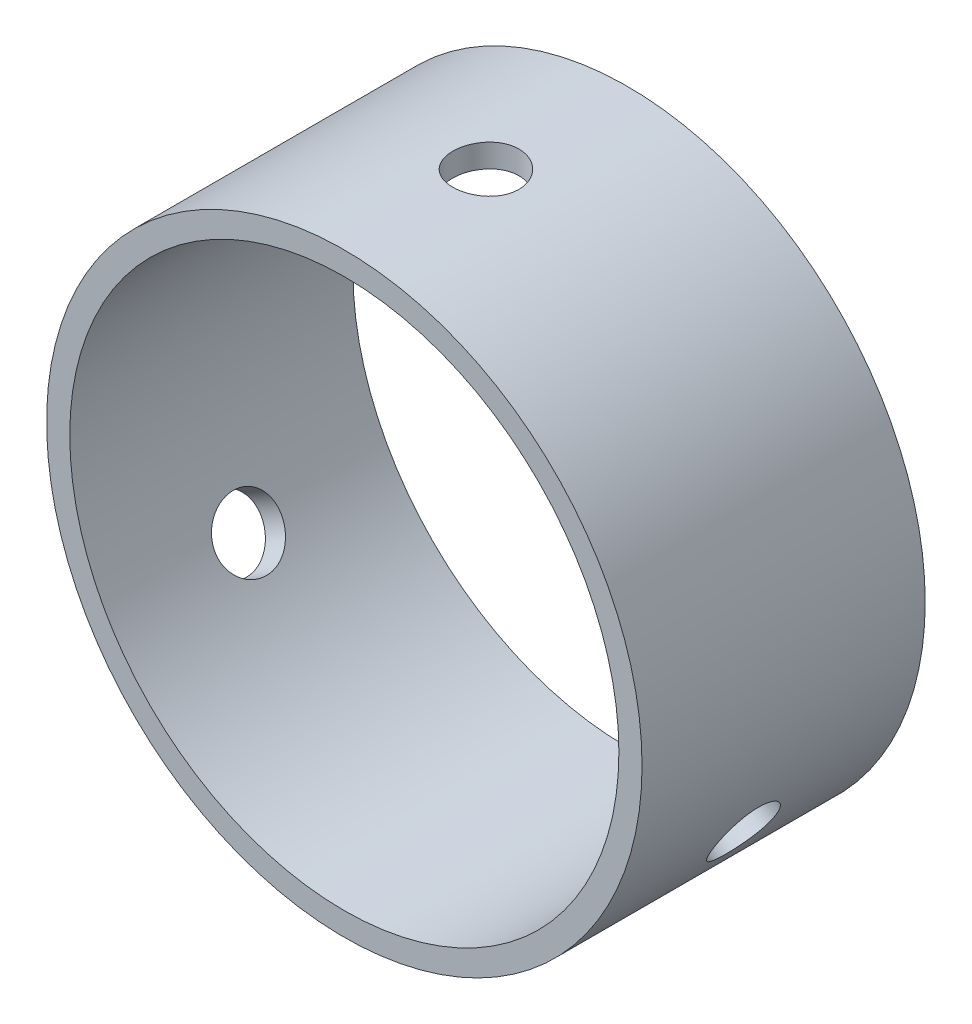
ISO-10303-21;
HEADER;
FILE_DESCRIPTION(('STEP AP214'),'2;1');
FILE_NAME('part.step','',(''),(''),'','','');
FILE_SCHEMA(('AUTOMOTIVE_DESIGN { 1 0 10303 214 1 1 1 1 }'));
ENDSEC;
DATA;
#1=APPLICATION_CONTEXT('core data for automotive mechanical design processes');
#2=APPLICATION_PROTOCOL_DEFINITION('international standard','automotive_design',2000,#1);
#3=PRODUCT_CONTEXT('',#1,'mechanical');
#4=PRODUCT('Part','Part','',(#3));
#5=PRODUCT_RELATED_PRODUCT_CATEGORY('part','',(#4));
#6=PRODUCT_DEFINITION_FORMATION('','',#4);
#7=PRODUCT_DEFINITION_CONTEXT('part definition',#1,'design');
#8=PRODUCT_DEFINITION('design','',#6,#7);
#9=PRODUCT_DEFINITION_SHAPE('','',#8);
#10=(LENGTH_UNIT() NAMED_UNIT(*) SI_UNIT(.MILLI.,.METRE.));
#11=(NAMED_UNIT(*) PLANE_ANGLE_UNIT() SI_UNIT($,.RADIAN.));
#12=(NAMED_UNIT(*) SI_UNIT($,.STERADIAN.) SOLID_ANGLE_UNIT());
#13=UNCERTAINTY_MEASURE_WITH_UNIT(LENGTH_MEASURE(1.E-05),#10,'distance_accuracy_value','');
#14=(GEOMETRIC_REPRESENTATION_CONTEXT(3) GLOBAL_UNCERTAINTY_ASSIGNED_CONTEXT((#13)) GLOBAL_UNIT_ASSIGNED_CONTEXT((#10,
#11,#12)) REPRESENTATION_CONTEXT('',''));
#15=CARTESIAN_POINT('',(0.,0.,0.));
#16=DIRECTION('',(0.,0.,1.));
#17=DIRECTION('',(1.,0.,0.));
#18=AXIS2_PLACEMENT_3D('',#15,#16,#17);
#19=CARTESIAN_POINT('',(0.,0.,27.178));
#20=DIRECTION('',(0.,0.,1.));
#21=DIRECTION('',(1.,0.,0.));
#22=AXIS2_PLACEMENT_3D('',#19,#20,#21);
#23=PLANE('',#22);
#24=CARTESIAN_POINT('',(0.,0.,27.178));
#25=DIRECTION('',(0.,0.,1.));
#26=DIRECTION('',(1.,0.,0.));
#27=AXIS2_PLACEMENT_3D('',#24,#25,#26);
#28=CIRCLE('',#27,57.15);
#29=CARTESIAN_POINT('',(57.15,0.,27.178));
#30=VERTEX_POINT('',#29);
#31=EDGE_CURVE('E10',#30,#30,#28,.T.);
#32=ORIENTED_EDGE('',*,*,#31,.T.);
#33=EDGE_LOOP('',(#32));
#34=FACE_BOUND('',#33,.T.);
#35=CARTESIAN_POINT('',(0.,0.,27.178));
#36=DIRECTION('',(0.,0.,1.));
#37=DIRECTION('',(1.,0.,0.));
#38=AXIS2_PLACEMENT_3D('',#35,#36,#37);
#39=CIRCLE('',#38,52.705);
#40=CARTESIAN_POINT('',(52.705,0.,27.178));
#41=VERTEX_POINT('',#40);
#42=EDGE_CURVE('E43',#41,#41,#39,.T.);
#43=ORIENTED_EDGE('',*,*,#42,.F.);
#44=EDGE_LOOP('',(#43));
#45=FACE_BOUND('',#44,.T.);
#46=ADVANCED_FACE('F32',(#34,#45),#23,.T.);
#47=CARTESIAN_POINT('',(0.,0.,-27.178));
#48=DIRECTION('',(0.,0.,1.));
#49=DIRECTION('',(1.,0.,0.));
#50=AXIS2_PLACEMENT_3D('',#47,#48,#49);
#51=PLANE('',#50);
#52=CARTESIAN_POINT('',(0.,0.,-27.178));
#53=DIRECTION('',(0.,0.,1.));
#54=DIRECTION('',(1.,0.,0.));
#55=AXIS2_PLACEMENT_3D('',#52,#53,#54);
#56=CIRCLE('',#55,57.15);
#57=CARTESIAN_POINT('',(57.15,0.,-27.178));
#58=VERTEX_POINT('',#57);
#59=EDGE_CURVE('E39',#58,#58,#56,.T.);
#60=ORIENTED_EDGE('',*,*,#59,.F.);
#61=EDGE_LOOP('',(#60));
#62=FACE_BOUND('',#61,.T.);
#63=CARTESIAN_POINT('',(0.,0.,-27.178));
#64=DIRECTION('',(0.,0.,1.));
#65=DIRECTION('',(1.,0.,0.));
#66=AXIS2_PLACEMENT_3D('',#63,#64,#65);
#67=CIRCLE('',#66,52.705);
#68=CARTESIAN_POINT('',(52.705,0.,-27.178));
#69=VERTEX_POINT('',#68);
#70=EDGE_CURVE('E47',#69,#69,#67,.T.);
#71=ORIENTED_EDGE('',*,*,#70,.T.);
#72=EDGE_LOOP('',(#71));
#73=FACE_BOUND('',#72,.T.);
#74=ADVANCED_FACE('F116',(#62,#73),#51,.F.);
#75=CARTESIAN_POINT('',(0.,0.,27.178));
#76=DIRECTION('',(0.,0.,-1.));
#77=DIRECTION('',(-1.,0.,0.));
#78=AXIS2_PLACEMENT_3D('',#75,#76,#77);
#79=CYLINDRICAL_SURFACE('',#78,57.15);
#80=CARTESIAN_POINT('',(-46.0118884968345,-33.8973246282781,0.));
#81=CARTESIAN_POINT('',(-46.0118870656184,-33.8973259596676,0.177812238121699));
#82=CARTESIAN_POINT('',(-46.0163488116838,-33.8912725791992,0.355596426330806));
#83=CARTESIAN_POINT('',(-46.0341459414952,-33.8670952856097,0.709952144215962));
#84=CARTESIAN_POINT('',(-46.0474834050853,-33.8489685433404,0.886523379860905));
#85=CARTESIAN_POINT('',(-46.0829049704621,-33.8007287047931,1.23726980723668));
#86=CARTESIAN_POINT('',(-46.1049958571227,-33.7706063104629,1.41144303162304));
#87=CARTESIAN_POINT('',(-46.1576955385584,-33.6985405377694,1.75608310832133));
#88=CARTESIAN_POINT('',(-46.1883074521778,-33.6565928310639,1.92654857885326));
#89=CARTESIAN_POINT('',(-46.2576849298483,-33.5611763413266,2.26232926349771));
#90=CARTESIAN_POINT('',(-46.2964422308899,-33.507719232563,2.42764950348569));
#91=CARTESIAN_POINT('',(-46.3817391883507,-33.3895504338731,2.75221864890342));
#92=CARTESIAN_POINT('',(-46.4282817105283,-33.3248345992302,2.91146529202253));
#93=CARTESIAN_POINT('',(-46.5286319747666,-33.1845797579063,3.22262180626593));
#94=CARTESIAN_POINT('',(-46.582435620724,-33.1090468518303,3.37453574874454));
#95=CARTESIAN_POINT('',(-46.6968070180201,-32.9475417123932,3.6701211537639));
#96=CARTESIAN_POINT('',(-46.757377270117,-32.8615656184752,3.81378953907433));
#97=CARTESIAN_POINT('',(-46.8848968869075,-32.6793719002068,4.09232713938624));
#98=CARTESIAN_POINT('',(-46.9518684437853,-32.5831185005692,4.22716279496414));
#99=CARTESIAN_POINT('',(-47.0913793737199,-32.381160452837,4.48657227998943));
#100=CARTESIAN_POINT('',(-47.1639207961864,-32.2754523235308,4.61114229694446));
#101=CARTESIAN_POINT('',(-47.3138346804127,-32.0552846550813,4.84905379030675));
#102=CARTESIAN_POINT('',(-47.3912055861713,-31.9408279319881,4.96239885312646));
#103=CARTESIAN_POINT('',(-47.5501084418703,-31.7037860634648,5.17714752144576));
#104=CARTESIAN_POINT('',(-47.6316419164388,-31.5811979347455,5.2785467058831));
#105=CARTESIAN_POINT('',(-47.7982888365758,-31.3284063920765,5.46884862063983));
#106=CARTESIAN_POINT('',(-47.883409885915,-31.1981865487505,5.55772287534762));
#107=CARTESIAN_POINT('',(-48.0563311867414,-30.9311630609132,5.72209622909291));
#108=CARTESIAN_POINT('',(-48.1441324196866,-30.7943569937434,5.79759035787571));
#109=CARTESIAN_POINT('',(-48.3215932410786,-30.515134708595,5.93458795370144));
#110=CARTESIAN_POINT('',(-48.4112520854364,-30.3727207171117,5.9960969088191));
#111=CARTESIAN_POINT('',(-48.5917059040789,-30.0831817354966,6.10472910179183));
#112=CARTESIAN_POINT('',(-48.6825012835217,-29.9360550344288,6.15184704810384));
#113=CARTESIAN_POINT('',(-48.9546451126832,-29.4904280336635,6.27064807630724));
#114=CARTESIAN_POINT('',(-49.1366928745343,-29.1862035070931,6.32050140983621));
#115=CARTESIAN_POINT('',(-49.4965717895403,-28.5716453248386,6.36001929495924));
#116=CARTESIAN_POINT('',(-49.6744030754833,-28.2613118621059,6.3496857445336));
#117=CARTESIAN_POINT('',(-50.0202000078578,-27.6446459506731,6.26939983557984));
#118=CARTESIAN_POINT('',(-50.1882057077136,-27.3383018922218,6.19971062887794));
#119=CARTESIAN_POINT('',(-50.5109738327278,-26.7372493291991,6.00308110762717));
#120=CARTESIAN_POINT('',(-50.6657360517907,-26.4425410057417,5.87613990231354));
#121=CARTESIAN_POINT('',(-50.9589714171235,-25.8729331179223,5.56833042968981));
#122=CARTESIAN_POINT('',(-51.0974088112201,-25.598077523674,5.38734675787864));
#123=CARTESIAN_POINT('',(-51.3550280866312,-25.0772436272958,4.97667216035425));
#124=CARTESIAN_POINT('',(-51.4742092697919,-24.8312663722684,4.74697946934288));
#125=CARTESIAN_POINT('',(-51.6920298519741,-24.3745982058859,4.2439295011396));
#126=CARTESIAN_POINT('',(-51.7905548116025,-24.1641050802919,3.97034306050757));
#127=CARTESIAN_POINT('',(-51.964926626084,-23.7868080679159,3.38806306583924));
#128=CARTESIAN_POINT('',(-52.0407734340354,-23.62000427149,3.07936943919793));
#129=CARTESIAN_POINT('',(-52.168939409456,-23.3355678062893,2.43545050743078));
#130=CARTESIAN_POINT('',(-52.2212517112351,-23.2179494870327,2.10021749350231));
#131=CARTESIAN_POINT('',(-52.3017825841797,-23.0359725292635,1.41283050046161));
#132=CARTESIAN_POINT('',(-52.3300020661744,-22.9716118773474,1.06067716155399));
#133=CARTESIAN_POINT('',(-52.3619997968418,-22.898582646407,0.35145696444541));
#134=CARTESIAN_POINT('',(-52.3659076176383,-22.889618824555,-0.00557366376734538));
#135=CARTESIAN_POINT('',(-52.3495923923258,-22.9269072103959,-0.716177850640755));
#136=CARTESIAN_POINT('',(-52.3293697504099,-22.9731584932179,-1.06975146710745));
#137=CARTESIAN_POINT('',(-52.2650644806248,-23.1190786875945,-1.76245991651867));
#138=CARTESIAN_POINT('',(-52.2210446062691,-23.2186071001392,-2.10163020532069));
#139=CARTESIAN_POINT('',(-52.1096118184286,-23.4676235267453,-2.75700925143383));
#140=CARTESIAN_POINT('',(-52.0421982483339,-23.6171129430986,-3.07321736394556));
#141=CARTESIAN_POINT('',(-51.8843730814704,-23.9618505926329,-3.67515233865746));
#142=CARTESIAN_POINT('',(-51.7938662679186,-24.1572880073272,-3.96074587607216));
#143=CARTESIAN_POINT('',(-51.5911284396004,-24.5872795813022,-4.49198913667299));
#144=CARTESIAN_POINT('',(-51.4788967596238,-24.8218349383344,-4.73763763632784));
#145=CARTESIAN_POINT('',(-51.2338277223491,-25.323815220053,-5.18313199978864));
#146=CARTESIAN_POINT('',(-51.1009004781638,-25.5913824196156,-5.38276816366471));
#147=CARTESIAN_POINT('',(-50.8171689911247,-26.1502557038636,-5.72912280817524));
#148=CARTESIAN_POINT('',(-50.6663650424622,-26.4415613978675,-5.8758421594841));
#149=CARTESIAN_POINT('',(-50.3504296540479,-27.0383150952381,-6.11185343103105));
#150=CARTESIAN_POINT('',(-50.185330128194,-27.3437309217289,-6.20126970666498));
#151=CARTESIAN_POINT('',(-49.8443969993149,-27.96037101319,-6.32051726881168));
#152=CARTESIAN_POINT('',(-49.6685637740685,-28.2715950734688,-6.35035065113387));
#153=CARTESIAN_POINT('',(-49.4011212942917,-28.7347114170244,-6.34982016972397));
#154=CARTESIAN_POINT('',(-49.3115567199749,-28.8881345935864,-6.34216191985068));
#155=CARTESIAN_POINT('',(-49.1316620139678,-29.1930386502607,-6.3119902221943));
#156=CARTESIAN_POINT('',(-49.0413321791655,-29.344520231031,-6.28948229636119));
#157=CARTESIAN_POINT('',(-48.8605568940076,-29.6445475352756,-6.22975908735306));
#158=CARTESIAN_POINT('',(-48.7701114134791,-29.7930921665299,-6.19253843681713));
#159=CARTESIAN_POINT('',(-48.5898781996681,-30.0861398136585,-6.10368229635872));
#160=CARTESIAN_POINT('',(-48.500090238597,-30.23064428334,-6.05205206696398));
#161=CARTESIAN_POINT('',(-48.3218608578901,-30.5147241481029,-5.93473684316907));
#162=CARTESIAN_POINT('',(-48.2334196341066,-30.6542988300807,-5.86904982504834));
#163=CARTESIAN_POINT('',(-48.0586720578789,-30.9275416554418,-5.72412512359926));
#164=CARTESIAN_POINT('',(-47.9723649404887,-31.0612119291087,-5.64489237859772));
#165=CARTESIAN_POINT('',(-47.8025667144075,-31.3218984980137,-5.47339322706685));
#166=CARTESIAN_POINT('',(-47.719076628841,-31.4489123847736,-5.3811221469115));
#167=CARTESIAN_POINT('',(-47.5557140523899,-31.6954005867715,-5.18425529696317));
#168=CARTESIAN_POINT('',(-47.4758402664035,-31.8148776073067,-5.07966398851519));
#169=CARTESIAN_POINT('',(-47.3199699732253,-32.0462558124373,-4.85824813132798));
#170=CARTESIAN_POINT('',(-47.2439974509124,-32.1581112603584,-4.74135889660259));
#171=CARTESIAN_POINT('',(-47.097148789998,-32.3727970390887,-4.49669768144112));
#172=CARTESIAN_POINT('',(-47.0262708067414,-32.4756306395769,-4.36892967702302));
#173=CARTESIAN_POINT('',(-46.890218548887,-32.6717639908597,-4.10328703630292));
#174=CARTESIAN_POINT('',(-46.8250477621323,-32.7650579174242,-3.96540631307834));
#175=CARTESIAN_POINT('',(-46.7011206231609,-32.9414549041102,-3.68062394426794));
#176=CARTESIAN_POINT('',(-46.6423619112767,-33.0245617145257,-3.53372564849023));
#177=CARTESIAN_POINT('',(-46.5316284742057,-33.1804042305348,-3.23136658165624));
#178=CARTESIAN_POINT('',(-46.4796779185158,-33.2531030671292,-3.07587794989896));
#179=CARTESIAN_POINT('',(-46.3833533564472,-33.3873307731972,-2.75796380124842));
#180=CARTESIAN_POINT('',(-46.3389765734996,-33.4488637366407,-2.59554085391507));
#181=CARTESIAN_POINT('',(-46.2582739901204,-33.5603832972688,-2.26498564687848));
#182=CARTESIAN_POINT('',(-46.2219417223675,-33.6103791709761,-2.0968580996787));
#183=CARTESIAN_POINT('',(-46.1576782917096,-33.6985786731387,-1.7560277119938));
#184=CARTESIAN_POINT('',(-46.1297450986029,-33.7367851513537,-1.58332598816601));
#185=CARTESIAN_POINT('',(-46.0749405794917,-33.8116132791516,-1.17808987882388));
#186=CARTESIAN_POINT('',(-46.0513314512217,-33.8437301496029,-0.944260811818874));
#187=CARTESIAN_POINT('',(-46.0198064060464,-33.8865848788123,-0.473604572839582));
#188=CARTESIAN_POINT('',(-46.0118904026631,-33.8973228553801,-0.236777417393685));
#189=CARTESIAN_POINT('',(-46.0118884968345,-33.8973246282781,0.));
#190=B_SPLINE_CURVE_WITH_KNOTS('',3,(#80,#81,#82,#83,#84,#85,#86,#87,#88,#89,#90,#91,#92,#93,
#94,#95,#96,#97,#98,#99,#100,#101,#102,#103,#104,#105,#106,#107,#108,#109,#110,#111,#112,#113,
#114,#115,#116,#117,#118,#119,#120,#121,#122,#123,#124,#125,#126,#127,#128,#129,#130,#131,#132,
#133,#134,#135,#136,#137,#138,#139,#140,#141,#142,#143,#144,#145,#146,#147,#148,#149,#150,#151,
#152,#153,#154,#155,#156,#157,#158,#159,#160,#161,#162,#163,#164,#165,#166,#167,#168,#169,#170,
#171,#172,#173,#174,#175,#176,#177,#178,#179,#180,#181,#182,#183,#184,#185,#186,#187,#188,#189),
.UNSPECIFIED.,.T.,.F.,(4,2,2,2,2,2,2,2,2,2,2,2,2,2,2,2,2,2,2,2,2,2,2,2,2,2,2,2,2,2,2,2,2,2,2,2,
2,2,2,2,2,2,2,2,2,2,2,2,2,2,2,2,2,2,4),(0.,0.533229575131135,1.06658414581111,1.60035293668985,
2.13431735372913,2.66774268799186,3.20136481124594,3.73468715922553,4.26820726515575,
4.80364915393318,5.33928900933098,5.8747571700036,6.41042288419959,6.94728744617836,
7.48435101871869,8.02120347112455,8.55825308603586,9.62673898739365,10.695191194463,
11.7589309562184,12.822687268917,13.8887316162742,14.9548146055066,16.0266563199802,
17.0985002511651,18.1706566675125,19.2427725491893,20.3091695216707,21.3755486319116,
22.4391293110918,23.5027398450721,24.5708087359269,25.6389103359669,26.7117875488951,
27.7846471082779,28.8551704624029,29.925656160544,30.458590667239,30.9913271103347,
31.5242580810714,32.0569947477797,32.5898081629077,33.1224277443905,33.6552387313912,
34.1878573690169,34.7234326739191,35.2588130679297,35.7945183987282,36.3300259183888,
36.8673858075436,37.4045482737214,37.941277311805,38.4778765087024,39.187936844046,
39.8979932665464),.UNSPECIFIED.);
#191=CARTESIAN_POINT('',(-46.0118884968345,-33.8973246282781,0.));
#192=VERTEX_POINT('',#191);
#193=EDGE_CURVE('E98',#192,#192,#190,.T.);
#194=ORIENTED_EDGE('',*,*,#193,.F.);
#195=EDGE_LOOP('',(#194));
#196=FACE_BOUND('',#195,.T.);
#197=CARTESIAN_POINT('',(52.3618884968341,-22.8988020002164,0.));
#198=CARTESIAN_POINT('',(52.3618889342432,-22.8988000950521,0.1778122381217));
#199=CARTESIAN_POINT('',(52.3588774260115,-22.9056907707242,0.355596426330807));
#200=CARTESIAN_POINT('',(52.3468378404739,-22.93319218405,0.709952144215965));
#201=CARTESIAN_POINT('',(52.3378083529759,-22.9538061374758,0.886523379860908));
#202=CARTESIAN_POINT('',(52.3137422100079,-23.0086020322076,1.23726980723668));
#203=CARTESIAN_POINT('',(52.2987008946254,-23.0427944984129,1.41144303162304));
#204=CARTESIAN_POINT('',(52.2626399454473,-23.1244666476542,1.75608310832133));
#205=CARTESIAN_POINT('',(52.2416181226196,-23.1719511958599,1.92654857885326));
#206=CARTESIAN_POINT('',(52.1936737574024,-23.2797420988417,2.26232926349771));
#207=CARTESIAN_POINT('',(52.166757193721,-23.3400354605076,2.42764950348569));
#208=CARTESIAN_POINT('',(52.1070684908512,-23.4729891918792,2.75221864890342));
#209=CARTESIAN_POINT('',(52.0742941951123,-23.5456541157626,2.91146529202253));
#210=CARTESIAN_POINT('',(52.0030050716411,-23.7026874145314,3.22262180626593));
#211=CARTESIAN_POINT('',(51.9644934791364,-23.7870491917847,3.37453574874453));
#212=CARTESIAN_POINT('',(51.8818116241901,-23.966850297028,3.67012115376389));
#213=CARTESIAN_POINT('',(51.8376392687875,-24.0622937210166,3.81378953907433));
#214=CARTESIAN_POINT('',(51.7436146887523,-24.2638258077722,4.09232713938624));
#215=CARTESIAN_POINT('',(51.6937425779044,-24.3699515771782,4.22716279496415));
#216=CARTESIAN_POINT('',(51.5885972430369,-24.5917506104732,4.48657227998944));
#217=CARTESIAN_POINT('',(51.5333220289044,-24.707427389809,4.61114229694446));
#218=CARTESIAN_POINT('',(51.4176081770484,-24.9473404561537,4.84905379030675));
#219=CARTESIAN_POINT('',(51.3571712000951,-25.0715739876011,4.96239885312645));
#220=CARTESIAN_POINT('',(51.2313383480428,-25.3277088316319,5.17714752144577));
#221=CARTESIAN_POINT('',(51.1659406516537,-25.4596129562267,5.2785467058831));
#222=CARTESIAN_POINT('',(51.0303402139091,-25.7303291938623,5.46884862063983));
#223=CARTESIAN_POINT('',(50.9601270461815,-25.8691561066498,5.55772287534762));
#224=CARTESIAN_POINT('',(50.8153385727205,-26.1524220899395,5.72209622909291));
#225=CARTESIAN_POINT('',(50.7407616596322,-26.2968632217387,5.79759035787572));
#226=CARTESIAN_POINT('',(50.5876784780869,-26.5901599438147,5.93458795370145));
#227=CARTESIAN_POINT('',(50.5091737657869,-26.7390137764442,5.99609690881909));
#228=CARTESIAN_POINT('',(50.3486525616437,-27.0400608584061,6.10472910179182));
#229=CARTESIAN_POINT('',(50.2666347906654,-27.1922553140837,6.15184704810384));
#230=CARTESIAN_POINT('',(50.0167824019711,-27.6507522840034,6.27064807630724));
#231=CARTESIAN_POINT('',(49.8443401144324,-27.9605225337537,6.32050140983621));
#232=CARTESIAN_POINT('',(49.4920565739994,-28.5794659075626,6.36001929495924));
#233=CARTESIAN_POINT('',(49.3122155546,-28.8886390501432,6.3496857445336));
#234=CARTESIAN_POINT('',(48.9510656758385,-29.4964409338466,6.26939983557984));
#235=CARTESIAN_POINT('',(48.7697667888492,-29.795110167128,6.19971062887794));
#236=CARTESIAN_POINT('',(48.4106240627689,-30.3751618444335,6.00308110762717));
#237=CARTESIAN_POINT('',(48.2327802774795,-30.6565440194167,5.87613990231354));
#238=CARTESIAN_POINT('',(47.8861030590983,-31.1952972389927,5.56833042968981));
#239=CARTESIAN_POINT('',(47.7172898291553,-31.4526153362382,5.38734675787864));
#240=CARTESIAN_POINT('',(47.3950440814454,-31.9361371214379,4.97667216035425));
#241=CARTESIAN_POINT('',(47.2416121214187,-32.1623396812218,4.74697946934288));
#242=CARTESIAN_POINT('',(46.9550361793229,-32.57931192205,4.24392950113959));
#243=CARTESIAN_POINT('',(46.8220062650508,-32.769883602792,3.97034306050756));
#244=CARTESIAN_POINT('',(46.582443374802,-33.109542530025,3.38806306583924));
#245=CARTESIAN_POINT('',(46.4759104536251,-33.2586296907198,3.07936943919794));
#246=CARTESIAN_POINT('',(46.293664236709,-33.5118429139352,2.43545050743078));
#247=CARTESIAN_POINT('',(46.2179599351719,-33.6159558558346,2.10021749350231));
#248=CARTESIAN_POINT('',(46.1006287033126,-33.7766861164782,1.4128305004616));
#249=CARTESIAN_POINT('',(46.0590004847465,-33.8333052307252,1.06067716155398));
#250=CARTESIAN_POINT('',(46.011754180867,-33.8975306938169,0.351456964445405));
#251=CARTESIAN_POINT('',(46.0059451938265,-33.9053968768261,-0.00557366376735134));
#252=CARTESIAN_POINT('',(46.0300802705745,-33.8726232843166,-0.716177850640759));
#253=CARTESIAN_POINT('',(46.0600237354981,-33.8319843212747,-1.06975146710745));
#254=CARTESIAN_POINT('',(46.1542416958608,-33.7033342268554,-1.76245991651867));
#255=CARTESIAN_POINT('',(46.218425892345,-33.6154476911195,-2.10163020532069));
#256=CARTESIAN_POINT('',(46.3783640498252,-33.3944358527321,-2.75700925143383));
#257=CARTESIAN_POINT('',(46.4741188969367,-33.2613092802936,-3.07321736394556));
#258=CARTESIAN_POINT('',(46.6937578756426,-32.9522598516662,-3.67515233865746));
#259=CARTESIAN_POINT('',(46.817758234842,-32.7761599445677,-3.96074587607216));
#260=CARTESIAN_POINT('',(47.0887729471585,-32.3855880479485,-4.49198913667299));
#261=CARTESIAN_POINT('',(47.2357880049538,-32.1711148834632,-4.73763763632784));
#262=CARTESIAN_POINT('',(47.5479811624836,-31.7078887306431,-5.18313199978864));
#263=CARTESIAN_POINT('',(47.7132375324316,-31.4589867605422,-5.38276816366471));
#264=CARTESIAN_POINT('',(48.0553702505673,-30.9338314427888,-5.72912280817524));
#265=CARTESIAN_POINT('',(48.2322464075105,-30.6575785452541,-5.87584215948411));
#266=CARTESIAN_POINT('',(48.5910825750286,-30.0855936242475,-6.11185343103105));
#267=CARTESIAN_POINT('',(48.7730306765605,-29.7899053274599,-6.20126970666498));
#268=CARTESIAN_POINT('',(49.1365900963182,-29.1863285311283,-6.32051726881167));
#269=CARTESIAN_POINT('',(49.3182014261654,-28.8784404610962,-6.35035065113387));
#270=CARTESIAN_POINT('',(49.5855507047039,-28.4152703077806,-6.34982016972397));
#271=CARTESIAN_POINT('',(49.6736367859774,-28.2609935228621,-6.34216191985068));
#272=CARTESIAN_POINT('',(49.8477440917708,-27.9527481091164,-6.3119902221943));
#273=CARTESIAN_POINT('',(49.9337660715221,-27.7987793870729,-6.28948229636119));
#274=CARTESIAN_POINT('',(50.1032096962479,-27.4922097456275,-6.22975908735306));
#275=CARTESIAN_POINT('',(50.1866303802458,-27.3396093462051,-6.19253843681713));
#276=CARTESIAN_POINT('',(50.3503004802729,-27.0369989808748,-6.10368229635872));
#277=CARTESIAN_POINT('',(50.4305510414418,-26.8869880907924,-6.05205206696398));
#278=CARTESIAN_POINT('',(50.5874567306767,-26.590596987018,-5.93473684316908));
#279=CARTESIAN_POINT('',(50.6641113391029,-26.4442172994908,-5.86904982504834));
#280=CARTESIAN_POINT('',(50.8133727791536,-26.1562600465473,-5.72412512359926));
#281=CARTESIAN_POINT('',(50.8859810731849,-26.0146807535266,-5.64489237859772));
#282=CARTESIAN_POINT('',(51.0268431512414,-25.7372878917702,-5.47339322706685));
#283=CARTESIAN_POINT('',(51.0950953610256,-25.6014764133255,-5.3811221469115));
#284=CARTESIAN_POINT('',(51.2268791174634,-25.3367561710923,-5.18425529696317));
#285=CARTESIAN_POINT('',(51.2904123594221,-25.207844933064,-5.07966398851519));
#286=CARTESIAN_POINT('',(51.4128566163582,-24.957168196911,-4.85824813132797));
#287=CARTESIAN_POINT('',(51.4717400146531,-24.835446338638,-4.74135889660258));
#288=CARTESIAN_POINT('',(51.5842390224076,-24.6009287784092,-4.49669768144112));
#289=CARTESIAN_POINT('',(51.6378565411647,-24.4881298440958,-4.36892967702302));
#290=CARTESIAN_POINT('',(51.7396868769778,-24.2722384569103,-4.10328703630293));
#291=CARTESIAN_POINT('',(51.7878963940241,-24.1691519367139,-3.96540631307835));
#292=CARTESIAN_POINT('',(51.8786970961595,-23.9736293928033,-3.68062394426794));
#293=CARTESIAN_POINT('',(51.9212903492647,-23.8811894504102,-3.53372564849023));
#294=CARTESIAN_POINT('',(52.0008872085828,-23.7073702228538,-3.23136658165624));
#295=CARTESIAN_POINT('',(52.0378709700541,-23.6260303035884,-3.07587794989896));
#296=CARTESIAN_POINT('',(52.1059532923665,-23.4754969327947,-2.75796380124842));
#297=CARTESIAN_POINT('',(52.1370540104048,-23.406299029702,-2.59554085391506));
#298=CARTESIAN_POINT('',(52.193281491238,-23.2806487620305,-2.26498564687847));
#299=CARTESIAN_POINT('',(52.2184130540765,-23.2241861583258,-2.09685809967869));
#300=CARTESIAN_POINT('',(52.2626643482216,-23.1244326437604,-1.75602771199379));
#301=CARTESIAN_POINT('',(52.2817855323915,-23.0811385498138,-1.58332598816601));
#302=CARTESIAN_POINT('',(52.3191863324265,-22.9962623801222,-1.17808987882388));
#303=CARTESIAN_POINT('',(52.3351957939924,-22.9597578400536,-0.944260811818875));
#304=CARTESIAN_POINT('',(52.3565465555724,-22.9110289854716,-0.473604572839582));
#305=CARTESIAN_POINT('',(52.3618879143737,-22.8988045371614,-0.236777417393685));
#306=CARTESIAN_POINT('',(52.3618884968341,-22.8988020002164,0.));
#307=B_SPLINE_CURVE_WITH_KNOTS('',3,(#197,#198,#199,#200,#201,#202,#203,#204,#205,#206,#207,
#208,#209,#210,#211,#212,#213,#214,#215,#216,#217,#218,#219,#220,#221,#222,#223,#224,#225,#226,
#227,#228,#229,#230,#231,#232,#233,#234,#235,#236,#237,#238,#239,#240,#241,#242,#243,#244,#245,
#246,#247,#248,#249,#250,#251,#252,#253,#254,#255,#256,#257,#258,#259,#260,#261,#262,#263,#264,
#265,#266,#267,#268,#269,#270,#271,#272,#273,#274,#275,#276,#277,#278,#279,#280,#281,#282,#283,
#284,#285,#286,#287,#288,#289,#290,#291,#292,#293,#294,#295,#296,#297,#298,#299,#300,#301,#302,
#303,#304,#305,#306),.UNSPECIFIED.,.T.,.F.,(4,2,2,2,2,2,2,2,2,2,2,2,2,2,2,2,2,2,2,2,2,2,2,2,2,2,
2,2,2,2,2,2,2,2,2,2,2,2,2,2,2,2,2,2,2,2,2,2,2,2,2,2,2,2,4),(0.,0.533229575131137,
1.06658414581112,1.60035293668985,2.13431735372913,2.66774268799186,3.20136481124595,
3.73468715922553,4.26820726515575,4.80364915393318,5.33928900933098,5.87475717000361,
6.4104228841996,6.94728744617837,7.4843510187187,8.02120347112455,8.55825308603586,
9.62673898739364,10.695191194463,11.7589309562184,12.822687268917,13.8887316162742,
14.9548146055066,16.0266563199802,17.0985002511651,18.1706566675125,19.2427725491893,
20.3091695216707,21.3755486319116,22.4391293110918,23.5027398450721,24.5708087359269,
25.6389103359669,26.7117875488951,27.7846471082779,28.8551704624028,29.925656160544,
30.458590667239,30.9913271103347,31.5242580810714,32.0569947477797,32.5898081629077,
33.1224277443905,33.6552387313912,34.1878573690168,34.7234326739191,35.2588130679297,
35.7945183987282,36.3300259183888,36.8673858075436,37.4045482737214,37.941277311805,
38.4778765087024,39.187936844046,39.8979932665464),.UNSPECIFIED.);
#308=CARTESIAN_POINT('',(52.3618884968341,-22.8988020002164,0.));
#309=VERTEX_POINT('',#308);
#310=EDGE_CURVE('E80',#309,#309,#307,.T.);
#311=ORIENTED_EDGE('',*,*,#310,.F.);
#312=EDGE_LOOP('',(#311));
#313=FACE_BOUND('',#312,.T.);
#314=CARTESIAN_POINT('',(0.,57.15,6.35));
#315=CARTESIAN_POINT('',(0.177816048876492,57.1500005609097,6.35000186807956));
#316=CARTESIAN_POINT('',(0.355604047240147,57.1491684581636,6.34252829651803));
#317=CARTESIAN_POINT('',(0.709967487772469,57.145864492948,6.31269028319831));
#318=CARTESIAN_POINT('',(0.886542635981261,57.1433922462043,6.29032235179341));
#319=CARTESIAN_POINT('',(1.23729697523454,57.13687422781,6.23083196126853));
#320=CARTESIAN_POINT('',(1.41147420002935,57.1328272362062,6.19369806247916));
#321=CARTESIAN_POINT('',(1.75612236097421,57.1232725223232,6.10493324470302));
#322=CARTESIAN_POINT('',(1.92659191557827,57.1177642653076,6.05329701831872));
#323=CARTESIAN_POINT('',(2.26238128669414,57.1054492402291,5.93596916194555));
#324=CARTESIAN_POINT('',(2.42770611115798,57.0986437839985,5.87029172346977));
#325=CARTESIAN_POINT('',(2.75228402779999,57.0839192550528,5.72529804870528));
#326=CARTESIAN_POINT('',(2.91153485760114,57.0759997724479,5.64597678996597));
#327=CARTESIAN_POINT('',(3.22269899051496,57.0592759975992,5.47432784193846));
#328=CARTESIAN_POINT('',(3.37461636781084,57.0504722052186,5.38200748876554));
#329=CARTESIAN_POINT('',(3.67020768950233,57.0322190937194,5.18494353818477));
#330=CARTESIAN_POINT('',(3.81387855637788,57.0227695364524,5.0801953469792));
#331=CARTESIAN_POINT('',(4.09241269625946,57.0034579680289,4.85864558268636));
#332=CARTESIAN_POINT('',(4.22724289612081,56.9935946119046,4.74180254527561));
#333=CARTESIAN_POINT('',(4.48664142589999,56.9737613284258,4.49714869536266));
#334=CARTESIAN_POINT('',(4.61120594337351,56.9637913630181,4.36933384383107));
#335=CARTESIAN_POINT('',(4.84910668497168,56.9440331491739,4.10371076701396));
#336=CARTESIAN_POINT('',(4.96244648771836,56.9342448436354,3.96590575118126));
#337=CARTESIAN_POINT('',(5.17718505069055,56.915119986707,3.68117684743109));
#338=CARTESIAN_POINT('',(5.27857938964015,56.9057836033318,3.53424961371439));
#339=CARTESIAN_POINT('',(5.4688758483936,56.8878111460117,3.23200533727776));
#340=CARTESIAN_POINT('',(5.55774901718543,56.8791767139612,3.0766699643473));
#341=CARTESIAN_POINT('',(5.7221200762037,56.8628759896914,2.75895795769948));
#342=CARTESIAN_POINT('',(5.79761299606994,56.8552100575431,2.59657873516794));
#343=CARTESIAN_POINT('',(5.93460809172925,56.8410739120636,2.2660325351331));
#344=CARTESIAN_POINT('',(5.99611576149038,56.8346032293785,2.09786786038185));
#345=CARTESIAN_POINT('',(6.10474532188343,56.8230369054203,1.75689037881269));
#346=CARTESIAN_POINT('',(6.15186192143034,56.8179417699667,1.58407588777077));
#347=CARTESIAN_POINT('',(6.27065904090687,56.8050000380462,1.06207377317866));
#348=CARTESIAN_POINT('',(6.320509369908,56.7994199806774,0.707578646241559));
#349=CARTESIAN_POINT('',(6.3600194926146,56.7950085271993,-0.00459375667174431));
#350=CARTESIAN_POINT('',(6.34968121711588,56.796176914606,-0.362270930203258));
#351=CARTESIAN_POINT('',(6.26938780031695,56.8050955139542,-1.06919697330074));
#352=CARTESIAN_POINT('',(6.19970056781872,56.8128161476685,-1.41847647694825));
#353=CARTESIAN_POINT('',(6.00308367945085,56.8339262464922,-2.10033818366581));
#354=CARTESIAN_POINT('',(5.87615308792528,56.8473158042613,-2.43292011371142));
#355=CARTESIAN_POINT('',(5.56836564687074,56.8782881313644,-3.07280340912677));
#356=CARTESIAN_POINT('',(5.38739092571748,56.8958800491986,-3.38004762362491));
#357=CARTESIAN_POINT('',(4.97673546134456,56.9332677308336,-3.95990361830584));
#358=CARTESIAN_POINT('',(4.74705295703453,56.9530635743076,-4.23251414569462));
#359=CARTESIAN_POINT('',(4.24401024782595,56.992760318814,-4.73692207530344));
#360=CARTESIAN_POINT('',(3.97041879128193,57.0126612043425,-4.96848891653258));
#361=CARTESIAN_POINT('',(3.38812448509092,57.0502242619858,-5.38244538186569));
#362=CARTESIAN_POINT('',(3.07942158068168,57.0678864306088,-5.5648349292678));
#363=CARTESIAN_POINT('',(2.43550006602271,57.0989898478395,-5.87525419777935));
#364=CARTESIAN_POINT('',(2.10027521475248,57.1124300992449,-6.00327107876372));
#365=CARTESIAN_POINT('',(1.41290597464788,57.1335657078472,-6.20113623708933));
#366=CARTESIAN_POINT('',(1.06076221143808,57.1412612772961,-6.27098666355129));
#367=CARTESIAN_POINT('',(0.35154657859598,57.1500130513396,-6.35024098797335));
#368=CARTESIAN_POINT('',(-0.00548934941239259,57.1511041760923,-6.3599628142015));
#369=CARTESIAN_POINT('',(-0.716105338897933,57.1466180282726,-6.31952065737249));
#370=CARTESIAN_POINT('',(-1.06968545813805,57.1410408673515,-6.26935767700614));
#371=CARTESIAN_POINT('',(-1.76242681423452,57.1238668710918,-6.11083379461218));
#372=CARTESIAN_POINT('',(-2.1016227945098,57.1122855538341,-6.00262289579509));
#373=CARTESIAN_POINT('',(-2.75705020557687,57.0844013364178,-5.73122969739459));
#374=CARTESIAN_POINT('',(-3.07328100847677,57.0680983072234,-5.56804589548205));
#375=CARTESIAN_POINT('',(-3.67523162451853,57.0325045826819,-5.19055900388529));
#376=CARTESIAN_POINT('',(-3.96082056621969,57.0132018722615,-4.97604837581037));
#377=CARTESIAN_POINT('',(-4.49205294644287,56.9738102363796,-4.502291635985));
#378=CARTESIAN_POINT('',(-4.73769514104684,56.9537212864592,-4.24304413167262));
#379=CARTESIAN_POINT('',(-5.18317562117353,56.9149149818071,-3.68578465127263));
#380=CARTESIAN_POINT('',(-5.38280436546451,56.8962041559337,-3.38760466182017));
#381=CARTESIAN_POINT('',(-5.72914599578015,56.8623760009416,-2.7617497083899));
#382=CARTESIAN_POINT('',(-5.87585974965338,56.847258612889,-2.43407522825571));
#383=CARTESIAN_POINT('',(-6.11186737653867,56.8223696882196,-1.7593003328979));
#384=CARTESIAN_POINT('',(-6.2012831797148,56.8125868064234,-1.41224288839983));
#385=CARTESIAN_POINT('',(-6.32052646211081,56.7994472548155,-0.707729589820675));
#386=CARTESIAN_POINT('',(-6.3503560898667,56.7960903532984,-0.350274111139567));
#387=CARTESIAN_POINT('',(-6.34981731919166,56.7961452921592,0.184519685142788));
#388=CARTESIAN_POINT('',(-6.34215701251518,56.7970045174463,0.36216190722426));
#389=CARTESIAN_POINT('',(-6.31198264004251,56.8003667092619,0.716146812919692));
#390=CARTESIAN_POINT('',(-6.28947409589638,56.8028690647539,0.892489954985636));
#391=CARTESIAN_POINT('',(-6.22975114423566,56.809449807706,1.24269139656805));
#392=CARTESIAN_POINT('',(-6.19253136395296,56.8135287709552,1.4165487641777));
#393=CARTESIAN_POINT('',(-6.10367852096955,56.823143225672,1.76043447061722));
#394=CARTESIAN_POINT('',(-6.05205071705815,56.8286781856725,1.93046418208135));
#395=CARTESIAN_POINT('',(-5.93474215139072,56.841048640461,2.26558118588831));
#396=CARTESIAN_POINT('',(-5.86905942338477,56.8478843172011,2.43066778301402));
#397=CARTESIAN_POINT('',(-5.72414489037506,56.8626587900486,2.75465899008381));
#398=CARTESIAN_POINT('',(-5.64491802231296,56.8705971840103,2.91356582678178));
#399=CARTESIAN_POINT('',(-5.47343199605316,56.8873576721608,3.22421006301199));
#400=CARTESIAN_POINT('',(-5.38116816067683,56.8961800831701,3.3759448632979));
#401=CARTESIAN_POINT('',(-5.18431690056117,56.9144544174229,3.67107758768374));
#402=CARTESIAN_POINT('',(-5.07973393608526,56.9239061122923,3.8144785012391));
#403=CARTESIAN_POINT('',(-4.85832691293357,56.9432311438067,4.09279331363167));
#404=CARTESIAN_POINT('',(-4.74143725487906,56.9531065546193,4.22765488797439));
#405=CARTESIAN_POINT('',(-4.49677402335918,56.9729460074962,4.48701391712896));
#406=CARTESIAN_POINT('',(-4.36900442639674,56.9829100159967,4.61151512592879));
#407=CARTESIAN_POINT('',(-4.1033574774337,57.0026552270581,4.84940891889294));
#408=CARTESIAN_POINT('',(-3.96547404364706,57.0124363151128,4.96279472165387));
#409=CARTESIAN_POINT('',(-3.68068516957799,57.0315299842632,5.17753314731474));
#410=CARTESIAN_POINT('',(-3.53378308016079,57.0408427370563,5.27889019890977));
#411=CARTESIAN_POINT('',(-3.23142123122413,57.058771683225,5.4692264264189));
#412=CARTESIAN_POINT('',(-3.07593391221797,57.0673853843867,5.55816206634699));
#413=CARTESIAN_POINT('',(-2.75802228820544,57.0836328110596,5.72257173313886));
#414=CARTESIAN_POINT('',(-2.59560055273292,57.091266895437,5.79805069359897));
#415=CARTESIAN_POINT('',(-2.26504776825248,57.1053359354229,5.93498377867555));
#416=CARTESIAN_POINT('',(-2.09692142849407,57.1117718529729,5.99644916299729));
#417=CARTESIAN_POINT('',(-1.75609365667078,57.1232677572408,6.10496706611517));
#418=CARTESIAN_POINT('',(-1.58339334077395,57.1283280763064,6.15202306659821));
#419=CARTESIAN_POINT('',(-1.17814740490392,57.1383207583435,6.2442353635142));
#420=CARTESIAN_POINT('',(-0.944306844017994,57.1426827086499,6.2838578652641));
#421=CARTESIAN_POINT('',(-0.473627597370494,57.1485219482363,6.3367388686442));
#422=CARTESIAN_POINT('',(-0.236788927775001,57.149999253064,6.34999751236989));
#423=CARTESIAN_POINT('',(0.,57.15,6.35));
#424=B_SPLINE_CURVE_WITH_KNOTS('',3,(#314,#315,#316,#317,#318,#319,#320,#321,#322,#323,#324,
#325,#326,#327,#328,#329,#330,#331,#332,#333,#334,#335,#336,#337,#338,#339,#340,#341,#342,#343,
#344,#345,#346,#347,#348,#349,#350,#351,#352,#353,#354,#355,#356,#357,#358,#359,#360,#361,#362,
#363,#364,#365,#366,#367,#368,#369,#370,#371,#372,#373,#374,#375,#376,#377,#378,#379,#380,#381,
#382,#383,#384,#385,#386,#387,#388,#389,#390,#391,#392,#393,#394,#395,#396,#397,#398,#399,#400,
#401,#402,#403,#404,#405,#406,#407,#408,#409,#410,#411,#412,#413,#414,#415,#416,#417,#418,#419,
#420,#421,#422,#423),.UNSPECIFIED.,.T.,.F.,(4,2,2,2,2,2,2,2,2,2,2,2,2,2,2,2,2,2,2,2,2,2,2,2,2,2,
2,2,2,2,2,2,2,2,2,2,2,2,2,2,2,2,2,2,2,2,2,2,2,2,2,2,2,2,4),(0.,0.533241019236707,
1.06660701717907,1.60038703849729,2.13436266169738,2.66780112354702,3.20143637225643,
3.73477165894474,4.26830470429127,4.80373155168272,5.3393563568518,5.87480984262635,
6.41046089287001,6.94733081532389,7.48439975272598,8.02125734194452,8.55831207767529,
9.62681253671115,10.6952787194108,11.7589471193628,12.8226329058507,13.8886557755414,
14.9547171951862,16.0265894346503,17.0984633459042,18.1705902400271,19.2426775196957,
20.3090912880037,21.3754872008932,22.4391405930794,23.5028230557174,24.570881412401,
25.6389730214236,26.7118365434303,27.7846824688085,28.8552377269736,29.9257543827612,
30.4586639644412,30.9913754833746,31.5242817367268,32.0569937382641,32.5897803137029,
33.122373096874,33.6551574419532,34.1877494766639,34.723339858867,35.2587353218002,
35.7944554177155,36.3299776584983,36.8673321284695,37.4044891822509,37.9412131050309,
38.4778072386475,39.1879020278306,39.897992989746),.UNSPECIFIED.);
#425=CARTESIAN_POINT('',(0.,57.15,6.35));
#426=VERTEX_POINT('',#425);
#427=EDGE_CURVE('E59',#426,#426,#424,.T.);
#428=ORIENTED_EDGE('',*,*,#427,.F.);
#429=EDGE_LOOP('',(#428));
#430=FACE_BOUND('',#429,.T.);
#431=ORIENTED_EDGE('',*,*,#31,.F.);
#432=EDGE_LOOP('',(#431));
#433=FACE_BOUND('',#432,.T.);
#434=ORIENTED_EDGE('',*,*,#59,.T.);
#435=EDGE_LOOP('',(#434));
#436=FACE_BOUND('',#435,.T.);
#437=ADVANCED_FACE('F34',(#196,#313,#430,#433,#436),#79,.T.);
#438=CARTESIAN_POINT('',(0.,0.,27.178));
#439=DIRECTION('',(0.,0.,-1.));
#440=DIRECTION('',(-1.,0.,0.));
#441=AXIS2_PLACEMENT_3D('',#438,#439,#440);
#442=CYLINDRICAL_SURFACE('',#441,52.705);
#443=CARTESIAN_POINT('',(-42.1363770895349,-31.6597970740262,0.));
#444=CARTESIAN_POINT('',(-42.1363755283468,-31.6597984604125,0.177707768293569));
#445=CARTESIAN_POINT('',(-42.140894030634,-31.6537879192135,0.355386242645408));
#446=CARTESIAN_POINT('',(-42.1589158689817,-31.6297814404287,0.709529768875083));
#447=CARTESIAN_POINT('',(-42.1724212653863,-31.6117827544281,0.885994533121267));
#448=CARTESIAN_POINT('',(-42.2082839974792,-31.5638824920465,1.23652370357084));
#449=CARTESIAN_POINT('',(-42.2306480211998,-31.5339719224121,1.41058619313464));
#450=CARTESIAN_POINT('',(-42.2839900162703,-31.4624093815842,1.75500535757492));
#451=CARTESIAN_POINT('',(-42.3149711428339,-31.420753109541,1.92536065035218));
#452=CARTESIAN_POINT('',(-42.3851692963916,-31.3259942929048,2.26091875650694));
#453=CARTESIAN_POINT('',(-42.4243777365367,-31.2729036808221,2.42612673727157));
#454=CARTESIAN_POINT('',(-42.5106456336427,-31.1555345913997,2.75047739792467));
#455=CARTESIAN_POINT('',(-42.5577079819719,-31.0912519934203,2.90961781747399));
#456=CARTESIAN_POINT('',(-42.6591504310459,-30.951919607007,3.2205736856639));
#457=CARTESIAN_POINT('',(-42.7135264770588,-30.8768757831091,3.37239313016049));
#458=CARTESIAN_POINT('',(-42.8290781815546,-30.7163940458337,3.66780433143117));
#459=CARTESIAN_POINT('',(-42.8902563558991,-30.630952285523,3.81139301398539));
#460=CARTESIAN_POINT('',(-43.0190556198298,-30.4497993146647,4.08988537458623));
#461=CARTESIAN_POINT('',(-43.0867031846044,-30.3540456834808,4.22474921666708));
#462=CARTESIAN_POINT('',(-43.2275736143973,-30.1530920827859,4.48422480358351));
#463=CARTESIAN_POINT('',(-43.3007985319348,-30.0478886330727,4.60883273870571));
#464=CARTESIAN_POINT('',(-43.4520677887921,-29.8287201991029,4.84683202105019));
#465=CARTESIAN_POINT('',(-43.5301105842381,-29.7147580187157,4.96022693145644));
#466=CARTESIAN_POINT('',(-43.6903277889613,-29.4786810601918,5.17508803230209));
#467=CARTESIAN_POINT('',(-43.772503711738,-29.3565632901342,5.27654980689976));
#468=CARTESIAN_POINT('',(-43.9404292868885,-29.1046160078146,5.46703431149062));
#469=CARTESIAN_POINT('',(-44.0261880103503,-28.9747665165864,5.55602262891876));
#470=CARTESIAN_POINT('',(-44.2003234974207,-28.708426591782,5.72062279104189));
#471=CARTESIAN_POINT('',(-44.2887012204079,-28.5719337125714,5.79622966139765));
#472=CARTESIAN_POINT('',(-44.4672370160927,-28.2932711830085,5.93344818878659));
#473=CARTESIAN_POINT('',(-44.5573943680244,-28.1511038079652,5.99506539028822));
#474=CARTESIAN_POINT('',(-44.7387537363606,-27.861984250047,6.10390670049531));
#475=CARTESIAN_POINT('',(-44.8299561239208,-27.7150303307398,6.15112552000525));
#476=CARTESIAN_POINT('',(-45.1030293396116,-27.2700168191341,6.27015483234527));
#477=CARTESIAN_POINT('',(-45.2854447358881,-26.9661272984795,6.32016248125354));
#478=CARTESIAN_POINT('',(-45.6455896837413,-26.3519285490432,6.36001618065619));
#479=CARTESIAN_POINT('',(-45.8233194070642,-26.0416195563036,6.34986443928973));
#480=CARTESIAN_POINT('',(-46.16831219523,-25.4249503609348,6.26999773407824));
#481=CARTESIAN_POINT('',(-46.3356247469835,-25.1185780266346,6.20059184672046));
#482=CARTESIAN_POINT('',(-46.6566237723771,-24.5171935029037,6.00464874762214));
#483=CARTESIAN_POINT('',(-46.8103100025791,-24.2221815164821,5.87811051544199));
#484=CARTESIAN_POINT('',(-47.1011764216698,-23.6516194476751,5.57116954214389));
#485=CARTESIAN_POINT('',(-47.2383142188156,-23.3761200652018,5.39063241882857));
#486=CARTESIAN_POINT('',(-47.4932071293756,-22.8538157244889,4.98091465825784));
#487=CARTESIAN_POINT('',(-47.610961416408,-22.6070119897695,4.75173194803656));
#488=CARTESIAN_POINT('',(-47.8260647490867,-22.1483468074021,4.24949607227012));
#489=CARTESIAN_POINT('',(-47.923279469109,-21.9367172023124,3.97617356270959));
#490=CARTESIAN_POINT('',(-48.0951990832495,-21.5571889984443,3.39434354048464));
#491=CARTESIAN_POINT('',(-48.1699039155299,-21.3892905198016,3.08583593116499));
#492=CARTESIAN_POINT('',(-48.2961036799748,-21.1027967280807,2.44216086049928));
#493=CARTESIAN_POINT('',(-48.3475898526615,-20.9842200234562,2.10698339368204));
#494=CARTESIAN_POINT('',(-48.4268839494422,-20.8005776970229,1.41960270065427));
#495=CARTESIAN_POINT('',(-48.4546929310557,-20.7355096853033,1.06740023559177));
#496=CARTESIAN_POINT('',(-48.4863315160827,-20.6614211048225,0.358330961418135));
#497=CARTESIAN_POINT('',(-48.4903103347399,-20.6520517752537,0.00150722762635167));
#498=CARTESIAN_POINT('',(-48.4746597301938,-20.6887595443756,-0.708747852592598));
#499=CARTESIAN_POINT('',(-48.4550307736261,-20.7348355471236,-1.06217926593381));
#500=CARTESIAN_POINT('',(-48.392403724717,-20.880576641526,-1.75449446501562));
#501=CARTESIAN_POINT('',(-48.3494786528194,-20.9800742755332,-2.0934201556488));
#502=CARTESIAN_POINT('',(-48.2406388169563,-21.2291345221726,-2.74841234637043));
#503=CARTESIAN_POINT('',(-48.1747232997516,-21.3786987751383,-3.06447809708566));
#504=CARTESIAN_POINT('',(-48.0201111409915,-21.7237596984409,-3.66648505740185));
#505=CARTESIAN_POINT('',(-47.9313041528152,-21.9194784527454,-3.95227061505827));
#506=CARTESIAN_POINT('',(-47.7320329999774,-22.3500824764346,-4.48401842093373));
#507=CARTESIAN_POINT('',(-47.6215680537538,-22.5849691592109,-4.72997923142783));
#508=CARTESIAN_POINT('',(-47.3798276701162,-23.0878116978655,-5.1764144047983));
#509=CARTESIAN_POINT('',(-47.2484453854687,-23.3559356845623,-5.37664162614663));
#510=CARTESIAN_POINT('',(-46.9674863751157,-23.9158984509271,-5.72421594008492));
#511=CARTESIAN_POINT('',(-46.8179099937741,-24.2077367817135,-5.87156403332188));
#512=CARTESIAN_POINT('',(-46.5040300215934,-24.8053595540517,-6.10879374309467));
#513=CARTESIAN_POINT('',(-46.3397645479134,-25.1111069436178,-6.19881943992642));
#514=CARTESIAN_POINT('',(-45.9999753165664,-25.7282532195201,-6.31929356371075));
#515=CARTESIAN_POINT('',(-45.8244520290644,-26.0396518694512,-6.34974447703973));
#516=CARTESIAN_POINT('',(-45.5571498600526,-26.502735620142,-6.35012507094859));
#517=CARTESIAN_POINT('',(-45.4676221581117,-26.6560267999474,-6.34278150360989));
#518=CARTESIAN_POINT('',(-45.2876704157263,-26.9606214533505,-6.31326161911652));
#519=CARTESIAN_POINT('',(-45.1972467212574,-27.1119256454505,-6.29109082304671));
#520=CARTESIAN_POINT('',(-45.0161566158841,-27.4115551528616,-6.2320629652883));
#521=CARTESIAN_POINT('',(-44.9254901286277,-27.5598793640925,-6.19520056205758));
#522=CARTESIAN_POINT('',(-44.7446944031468,-27.8524487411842,-6.1070805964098));
#523=CARTESIAN_POINT('',(-44.6545649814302,-27.9966953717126,-6.05582827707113));
#524=CARTESIAN_POINT('',(-44.4755491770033,-28.2802168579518,-5.93929265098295));
#525=CARTESIAN_POINT('',(-44.3866628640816,-28.4194914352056,-5.87400855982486));
#526=CARTESIAN_POINT('',(-44.2109246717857,-28.6921149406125,-5.7299087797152));
#527=CARTESIAN_POINT('',(-44.1240720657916,-28.8254660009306,-5.65109801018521));
#528=CARTESIAN_POINT('',(-43.9530946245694,-29.0855071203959,-5.48045917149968));
#529=CARTESIAN_POINT('',(-43.8689707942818,-29.2121947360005,-5.38862637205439));
#530=CARTESIAN_POINT('',(-43.7042676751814,-29.4580362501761,-5.19264860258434));
#531=CARTESIAN_POINT('',(-43.6236871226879,-29.5771928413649,-5.08850807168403));
#532=CARTESIAN_POINT('',(-43.4662706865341,-29.8080523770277,-4.86790431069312));
#533=CARTESIAN_POINT('',(-43.3894623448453,-29.9197022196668,-4.75136584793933));
#534=CARTESIAN_POINT('',(-43.240911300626,-30.1339942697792,-4.50738860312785));
#535=CARTESIAN_POINT('',(-43.1691667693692,-30.2366397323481,-4.37995379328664));
#536=CARTESIAN_POINT('',(-43.0313700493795,-30.4324261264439,-4.11495577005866));
#537=CARTESIAN_POINT('',(-42.9653213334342,-30.5255612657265,-3.97738647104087));
#538=CARTESIAN_POINT('',(-42.8396483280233,-30.7016817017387,-3.69319954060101));
#539=CARTESIAN_POINT('',(-42.7800216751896,-30.7846707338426,-3.54658526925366));
#540=CARTESIAN_POINT('',(-42.667550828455,-30.9403683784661,-3.24468504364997));
#541=CARTESIAN_POINT('',(-42.6147345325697,-31.0130348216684,-3.08936694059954));
#542=CARTESIAN_POINT('',(-42.5167380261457,-31.1472457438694,-2.77175005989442));
#543=CARTESIAN_POINT('',(-42.471555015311,-31.2087943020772,-2.60945386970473));
#544=CARTESIAN_POINT('',(-42.3893192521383,-31.3203998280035,-2.27910395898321));
#545=CARTESIAN_POINT('',(-42.3522600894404,-31.3704658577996,-2.11105489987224));
#546=CARTESIAN_POINT('',(-42.2866404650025,-31.458863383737,-1.77033578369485));
#547=CARTESIAN_POINT('',(-42.2580779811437,-31.4971976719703,-1.59766683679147));
#548=CARTESIAN_POINT('',(-42.2016280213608,-31.5728140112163,-1.19018276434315));
#549=CARTESIAN_POINT('',(-42.1771973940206,-31.6054073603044,-0.953994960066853));
#550=CARTESIAN_POINT('',(-42.1445730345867,-31.6488978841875,-0.478520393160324));
#551=CARTESIAN_POINT('',(-42.1363791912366,-31.6597952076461,-0.239233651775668));
#552=CARTESIAN_POINT('',(-42.1363770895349,-31.6597970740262,0.));
#553=B_SPLINE_CURVE_WITH_KNOTS('',3,(#443,#444,#445,#446,#447,#448,#449,#450,#451,#452,#453,
#454,#455,#456,#457,#458,#459,#460,#461,#462,#463,#464,#465,#466,#467,#468,#469,#470,#471,#472,
#473,#474,#475,#476,#477,#478,#479,#480,#481,#482,#483,#484,#485,#486,#487,#488,#489,#490,#491,
#492,#493,#494,#495,#496,#497,#498,#499,#500,#501,#502,#503,#504,#505,#506,#507,#508,#509,#510,
#511,#512,#513,#514,#515,#516,#517,#518,#519,#520,#521,#522,#523,#524,#525,#526,#527,#528,#529,
#530,#531,#532,#533,#534,#535,#536,#537,#538,#539,#540,#541,#542,#543,#544,#545,#546,#547,#548,
#549,#550,#551,#552),.UNSPECIFIED.,.T.,.F.,(4,2,2,2,2,2,2,2,2,2,2,2,2,2,2,2,2,2,2,2,2,2,2,2,2,2,
2,2,2,2,2,2,2,2,2,2,2,2,2,2,2,2,2,2,2,2,2,2,2,2,2,2,2,2,4),(0.,0.532913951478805,
1.0659501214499,1.5993894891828,2.13302443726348,2.66610517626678,3.19938260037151,
3.73236558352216,4.26554635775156,4.80101096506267,5.33667358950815,5.87216544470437,
6.40785483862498,6.94499420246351,7.48233282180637,8.01945810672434,8.55678046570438,
9.62503243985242,10.6932452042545,11.755919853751,12.8186134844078,13.8839740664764,
14.949380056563,16.0215515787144,17.0937260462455,18.1663046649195,19.238835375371,
20.3046432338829,21.3704300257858,22.4328952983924,23.4953953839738,24.5631162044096,
25.6308755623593,26.7042752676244,27.7776546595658,28.8483253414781,29.9189513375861,
30.4514489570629,30.9837484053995,31.5162415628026,32.048540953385,32.5808701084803,
33.1130060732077,33.6453358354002,34.177474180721,34.7130488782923,35.2484291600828,
35.7841335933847,36.3196402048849,36.8572751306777,37.3947123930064,37.9317240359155,
38.4686077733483,39.186031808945,39.9034509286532),.UNSPECIFIED.);
#554=CARTESIAN_POINT('',(-42.1363770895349,-31.6597970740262,0.));
#555=VERTEX_POINT('',#554);
#556=EDGE_CURVE('E101',#555,#555,#553,.T.);
#557=ORIENTED_EDGE('',*,*,#556,.T.);
#558=EDGE_LOOP('',(#557));
#559=FACE_BOUND('',#558,.T.);
#560=CARTESIAN_POINT('',(48.4863770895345,-20.6612744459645,0.));
#561=CARTESIAN_POINT('',(48.4863775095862,-20.6612724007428,0.177707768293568));
#562=CARTESIAN_POINT('',(48.483431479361,-20.6681908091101,0.355386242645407));
#563=CARTESIAN_POINT('',(48.4716521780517,-20.6958014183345,0.70952976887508));
#564=CARTESIAN_POINT('',(48.4628175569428,-20.7164967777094,0.885994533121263));
#565=CARTESIAN_POINT('',(48.4392660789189,-20.7715049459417,1.23652370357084));
#566=CARTESIAN_POINT('',(48.4245447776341,-20.8058280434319,1.41058619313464));
#567=CARTESIAN_POINT('',(48.389240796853,-20.8878048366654,1.75500535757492));
#568=CARTESIAN_POINT('',(48.3686559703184,-20.9354634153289,1.92536065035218));
#569=CARTESIAN_POINT('',(48.3216915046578,-21.0436362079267,2.26091875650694));
#570=CARTESIAN_POINT('',(48.2953179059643,-21.1041370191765,2.42612673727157));
#571=CARTESIAN_POINT('',(48.2368072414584,-21.2375317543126,2.75047739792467));
#572=CARTESIAN_POINT('',(48.2046680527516,-21.3104302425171,2.90961781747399));
#573=CARTESIAN_POINT('',(48.1347238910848,-21.4679481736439,3.22057368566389));
#574=CARTESIAN_POINT('',(48.0969220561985,-21.5525611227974,3.37239313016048));
#575=CARTESIAN_POINT('',(48.0157166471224,-21.732872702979,3.66780433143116));
#576=CARTESIAN_POINT('',(47.9723109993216,-21.8285754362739,3.81139301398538));
#577=CARTESIAN_POINT('',(47.8798275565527,-22.0306953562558,4.08988537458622));
#578=CARTESIAN_POINT('',(47.8307262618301,-22.1371566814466,4.22474921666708));
#579=CARTESIAN_POINT('',(47.7271305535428,-22.3596308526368,4.4842248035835));
#580=CARTESIAN_POINT('',(47.6726341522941,-22.4756472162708,4.60883273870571));
#581=CARTESIAN_POINT('',(47.5584633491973,-22.7162344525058,4.84683202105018));
#582=CARTESIAN_POINT('',(47.4987906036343,-22.840802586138,4.96022693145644));
#583=CARTESIAN_POINT('',(47.374450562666,-23.0975932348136,5.17508803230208));
#584=CARTESIAN_POINT('',(47.309781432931,-23.2298185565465,5.27654980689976));
#585=CARTESIAN_POINT('',(47.175551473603,-23.5012200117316,5.46703431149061));
#586=CARTESIAN_POINT('',(47.1059778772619,-23.6404139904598,5.55602262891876));
#587=CARTESIAN_POINT('',(46.9623884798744,-23.9243897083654,5.72062279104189));
#588=CARTESIAN_POINT('',(46.8883710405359,-24.0691735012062,5.79622966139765));
#589=CARTESIAN_POINT('',(46.736310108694,-24.3631213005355,5.93344818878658));
#590=CARTESIAN_POINT('',(46.658268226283,-24.512283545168,5.99506539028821));
#591=CARTESIAN_POINT('',(46.4985630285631,-24.8139051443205,6.1039067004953));
#592=CARTESIAN_POINT('',(46.4168983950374,-24.9663656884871,6.15112552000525));
#593=CARTESIAN_POINT('',(46.1680419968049,-25.4253607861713,6.27015483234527));
#594=CARTESIAN_POINT('',(45.9960736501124,-25.7352819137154,6.32016248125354));
#595=CARTESIAN_POINT('',(45.6442344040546,-26.354275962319,6.36001618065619));
#596=CARTESIAN_POINT('',(45.4643637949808,-26.663348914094,6.34986443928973));
#597=CARTESIAN_POINT('',(45.102809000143,-27.2704560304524,6.26999773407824));
#598=CARTESIAN_POINT('',(44.921139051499,-27.5685391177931,6.20059184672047));
#599=CARTESIAN_POINT('',(44.560824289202,-28.1472246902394,6.00464874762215));
#600=CARTESIAN_POINT('',(44.382179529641,-28.427826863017,5.878110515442));
#601=CARTESIAN_POINT('',(44.0334914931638,-28.9650056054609,5.5711695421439));
#602=CARTESIAN_POINT('',(43.8634709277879,-29.2215201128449,5.39063241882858));
#603=CARTESIAN_POINT('',(43.5385885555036,-29.7034160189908,4.98091465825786));
#604=CARTESIAN_POINT('',(43.3837273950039,-29.9287960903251,4.75173194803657));
#605=CARTESIAN_POINT('',(43.0940633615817,-30.3444136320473,4.24949607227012));
#606=CARTESIAN_POINT('',(42.9593941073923,-30.5344188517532,3.97617356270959));
#607=CARTESIAN_POINT('',(42.7166728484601,-30.8730697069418,3.39434354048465));
#608=CARTESIAN_POINT('',(42.6086209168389,-31.0217152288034,3.085835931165));
#609=CARTESIAN_POINT('',(42.4236098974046,-31.2742543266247,2.44216086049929));
#610=CARTESIAN_POINT('',(42.346662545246,-31.3781310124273,2.10698339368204));
#611=CARTESIAN_POINT('',(42.2272706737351,-31.5386228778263,1.41960270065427));
#612=CARTESIAN_POINT('',(42.1848246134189,-31.5952401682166,1.06740023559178));
#613=CARTESIAN_POINT('',(42.1364813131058,-31.6596842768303,0.35833096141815));
#614=CARTESIAN_POINT('',(42.1303566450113,-31.6678146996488,0.0015072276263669));
#615=CARTESIAN_POINT('',(42.154321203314,-31.6359069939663,-0.708747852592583));
#616=CARTESIAN_POINT('',(42.1844097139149,-31.5958698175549,-1.0621792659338));
#617=CARTESIAN_POINT('',(42.2793116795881,-31.4687626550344,-1.75449446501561));
#618=CARTESIAN_POINT('',(42.344016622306,-31.3818396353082,-2.09342015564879));
#619=CARTESIAN_POINT('',(42.505289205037,-31.1630514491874,-2.74841234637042));
#620=CARTESIAN_POINT('',(42.6018578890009,-31.0311848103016,-3.06447809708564));
#621=CARTESIAN_POINT('',(42.8233833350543,-30.7247562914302,-3.66648505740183));
#622=CARTESIAN_POINT('',(42.9484772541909,-30.5499878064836,-3.95227061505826));
#623=CARTESIAN_POINT('',(43.2217557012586,-30.1621119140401,-4.48401842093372));
#624=CARTESIAN_POINT('',(43.3699410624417,-29.9490031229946,-4.72997923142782));
#625=CARTESIAN_POINT('',(43.6845452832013,-29.4882285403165,-5.17641440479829));
#626=CARTESIAN_POINT('',(43.8510563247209,-29.2403861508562,-5.37664162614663));
#627=CARTESIAN_POINT('',(44.1955188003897,-28.717087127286,-5.72421594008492));
#628=CARTESIAN_POINT('',(44.373470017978,-28.4416310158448,-5.87156403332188));
#629=CARTESIAN_POINT('',(44.7340865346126,-27.8709916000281,-6.10879374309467));
#630=CARTESIAN_POINT('',(44.9167388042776,-27.5758598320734,-6.19881943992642));
#631=CARTESIAN_POINT('',(45.2813085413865,-26.9730205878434,-6.31929356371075));
#632=CARTESIAN_POINT('',(45.46322603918,-26.6653136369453,-6.34974447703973));
#633=CARTESIAN_POINT('',(45.7306172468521,-26.2022812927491,-6.35012507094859));
#634=CARTESIAN_POINT('',(45.8186074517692,-26.0481024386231,-6.34278150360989));
#635=CARTESIAN_POINT('',(45.9924182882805,-25.7399623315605,-6.31326161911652));
#636=CARTESIAN_POINT('',(46.0782397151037,-25.5860010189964,-6.29109082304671));
#637=CARTESIAN_POINT('',(46.2471814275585,-25.2793576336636,-6.2320629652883));
#638=CARTESIAN_POINT('',(46.3303007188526,-25.1266760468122,-6.19520056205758));
#639=CARTESIAN_POINT('',(46.4932753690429,-24.8238176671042,-6.1070805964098));
#640=CARTESIAN_POINT('',(46.5731319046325,-24.6736399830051,-6.05582827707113));
#641=CARTESIAN_POINT('',(46.7291608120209,-24.3768470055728,-5.93929265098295));
#642=CARTESIAN_POINT('',(46.8053329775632,-24.230231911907,-5.87400855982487));
#643=CARTESIAN_POINT('',(46.9535627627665,-23.9417264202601,-5.72990877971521));
#644=CARTESIAN_POINT('',(47.0256218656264,-23.7998343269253,-5.65109801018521));
#645=CARTESIAN_POINT('',(47.1653353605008,-23.5217429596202,-5.48045917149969));
#646=CARTESIAN_POINT('',(47.2329881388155,-23.3855457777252,-5.3886263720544));
#647=CARTESIAN_POINT('',(47.3635415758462,-23.1199879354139,-5.19264860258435));
#648=CARTESIAN_POINT('',(47.4264439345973,-22.9906248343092,-5.08850807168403));
#649=CARTESIAN_POINT('',(47.5476659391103,-22.7388684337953,-4.86790431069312));
#650=CARTESIAN_POINT('',(47.6059533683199,-22.6165255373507,-4.75136584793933));
#651=CARTESIAN_POINT('',(47.7172602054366,-22.3807305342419,-4.50738860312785));
#652=CARTESIAN_POINT('',(47.7702815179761,-22.2672752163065,-4.37995379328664));
#653=CARTESIAN_POINT('',(47.8709391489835,-22.0500465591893,-4.11495577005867));
#654=CARTESIAN_POINT('',(47.9185721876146,-21.9462791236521,-3.97738647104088));
#655=CARTESIAN_POINT('',(48.0082604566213,-21.7493828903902,-3.69319954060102));
#656=CARTESIAN_POINT('',(48.0503177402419,-21.6562501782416,-3.54658526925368));
#657=CARTESIAN_POINT('',(48.128920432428,-21.4809987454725,-3.24468504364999));
#658=CARTESIAN_POINT('',(48.1654432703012,-21.398925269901,-3.08936694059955));
#659=CARTESIAN_POINT('',(48.2326750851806,-21.2469523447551,-2.77175005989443));
#660=CARTESIAN_POINT('',(48.2633861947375,-21.177048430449,-2.60945386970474));
#661=CARTESIAN_POINT('',(48.318921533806,-21.0500274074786,-2.27910395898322));
#662=CARTESIAN_POINT('',(48.3437504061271,-20.9929002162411,-2.11105489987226));
#663=CARTESIAN_POINT('',(48.3874950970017,-20.8918731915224,-1.77033578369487));
#664=CARTESIAN_POINT('',(48.4064123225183,-20.8479702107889,-1.59766683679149));
#665=CARTESIAN_POINT('',(48.443673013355,-20.7612749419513,-1.19018276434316));
#666=CARTESIAN_POINT('',(48.4596843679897,-20.7238207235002,-0.953994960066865));
#667=CARTESIAN_POINT('',(48.4810360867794,-20.6738219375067,-0.478520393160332));
#668=CARTESIAN_POINT('',(48.4863765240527,-20.6612771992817,-0.239233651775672));
#669=CARTESIAN_POINT('',(48.4863770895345,-20.6612744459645,0.));
#670=B_SPLINE_CURVE_WITH_KNOTS('',3,(#560,#561,#562,#563,#564,#565,#566,#567,#568,#569,#570,
#571,#572,#573,#574,#575,#576,#577,#578,#579,#580,#581,#582,#583,#584,#585,#586,#587,#588,#589,
#590,#591,#592,#593,#594,#595,#596,#597,#598,#599,#600,#601,#602,#603,#604,#605,#606,#607,#608,
#609,#610,#611,#612,#613,#614,#615,#616,#617,#618,#619,#620,#621,#622,#623,#624,#625,#626,#627,
#628,#629,#630,#631,#632,#633,#634,#635,#636,#637,#638,#639,#640,#641,#642,#643,#644,#645,#646,
#647,#648,#649,#650,#651,#652,#653,#654,#655,#656,#657,#658,#659,#660,#661,#662,#663,#664,#665,
#666,#667,#668,#669),.UNSPECIFIED.,.T.,.F.,(4,2,2,2,2,2,2,2,2,2,2,2,2,2,2,2,2,2,2,2,2,2,2,2,2,2,
2,2,2,2,2,2,2,2,2,2,2,2,2,2,2,2,2,2,2,2,2,2,2,2,2,2,2,2,4),(0.,0.532913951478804,
1.06595012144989,1.59938948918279,2.13302443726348,2.66610517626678,3.19938260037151,
3.73236558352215,4.26554635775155,4.80101096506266,5.33667358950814,5.87216544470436,
6.40785483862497,6.94499420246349,7.48233282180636,8.01945810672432,8.55678046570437,
9.62503243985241,10.6932452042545,11.755919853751,12.8186134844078,13.8839740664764,
14.949380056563,16.0215515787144,17.0937260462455,18.1663046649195,19.238835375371,
20.3046432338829,21.3704300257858,22.4328952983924,23.4953953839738,24.5631162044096,
25.6308755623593,26.7042752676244,27.7776546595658,28.8483253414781,29.918951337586,
30.4514489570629,30.9837484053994,31.5162415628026,32.0485409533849,32.5808701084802,
33.1130060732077,33.6453358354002,34.177474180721,34.7130488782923,35.2484291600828,
35.7841335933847,36.3196402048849,36.8572751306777,37.3947123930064,37.9317240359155,
38.4686077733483,39.186031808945,39.9034509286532),.UNSPECIFIED.);
#671=CARTESIAN_POINT('',(48.4863770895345,-20.6612744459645,0.));
#672=VERTEX_POINT('',#671);
#673=EDGE_CURVE('E84',#672,#672,#670,.T.);
#674=ORIENTED_EDGE('',*,*,#673,.T.);
#675=EDGE_LOOP('',(#674));
#676=FACE_BOUND('',#675,.T.);
#677=CARTESIAN_POINT('',(0.,52.705,6.35));
#678=CARTESIAN_POINT('',(0.177713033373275,52.7050006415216,6.3500019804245));
#679=CARTESIAN_POINT('',(0.35539677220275,52.7040993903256,6.34253700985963));
#680=CARTESIAN_POINT('',(0.709550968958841,52.7005209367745,6.31273407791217));
#681=CARTESIAN_POINT('',(0.886021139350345,52.6978433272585,6.29039270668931));
#682=CARTESIAN_POINT('',(1.23656124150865,52.6907838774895,6.230974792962));
#683=CARTESIAN_POINT('',(1.41062925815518,52.6864007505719,6.19388712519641));
#684=CARTESIAN_POINT('',(1.75505959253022,52.6760523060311,6.10523536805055));
#685=CARTESIAN_POINT('',(1.92542052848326,52.6700864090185,6.05366597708));
#686=CARTESIAN_POINT('',(2.26099063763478,52.656748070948,5.93649505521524));
#687=CARTESIAN_POINT('',(2.42620495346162,52.6493770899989,5.87090808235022));
#688=CARTESIAN_POINT('',(2.75056773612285,52.6334283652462,5.72611845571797));
#689=CARTESIAN_POINT('',(2.90971394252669,52.6248501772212,5.64691078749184));
#690=CARTESIAN_POINT('',(3.22068034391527,52.6067342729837,5.47551097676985));
#691=CARTESIAN_POINT('',(3.37250453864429,52.5971970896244,5.38332603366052));
#692=CARTESIAN_POINT('',(3.6679239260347,52.5774218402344,5.18655414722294));
#693=CARTESIAN_POINT('',(3.81151604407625,52.5671835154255,5.08196261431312));
#694=CARTESIAN_POINT('',(4.09000363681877,52.5462508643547,4.86067221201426));
#695=CARTESIAN_POINT('',(4.22485994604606,52.5355547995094,4.74392421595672));
#696=CARTESIAN_POINT('',(4.48432040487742,52.5140443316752,4.49946139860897));
#697=CARTESIAN_POINT('',(4.608920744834,52.503229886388,4.37174253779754));
#698=CARTESIAN_POINT('',(4.84690517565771,52.4817950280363,4.10630889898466));
#699=CARTESIAN_POINT('',(4.96029281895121,52.4711745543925,3.96859731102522));
#700=CARTESIAN_POINT('',(5.17513995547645,52.4504204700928,3.68404945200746));
#701=CARTESIAN_POINT('',(5.27659503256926,52.4402870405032,3.53720983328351));
#702=CARTESIAN_POINT('',(5.46707198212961,52.4207720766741,3.23505856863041));
#703=CARTESIAN_POINT('',(5.55605878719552,52.4113926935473,3.07972467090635));
#704=CARTESIAN_POINT('',(5.72065575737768,52.3936826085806,2.76199674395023));
#705=CARTESIAN_POINT('',(5.7962609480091,52.3853522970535,2.59960011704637));
#706=CARTESIAN_POINT('',(5.9334760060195,52.3699882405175,2.26900040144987));
#707=CARTESIAN_POINT('',(5.99509142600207,52.3629539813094,2.10079964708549));
#708=CARTESIAN_POINT('',(6.10392909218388,52.350377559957,1.75973173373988));
#709=CARTESIAN_POINT('',(6.15114604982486,52.3448359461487,1.58686288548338));
#710=CARTESIAN_POINT('',(6.27016999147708,52.3307626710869,1.06492510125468));
#711=CARTESIAN_POINT('',(6.32017351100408,52.324687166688,0.710534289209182));
#712=CARTESIAN_POINT('',(6.3600165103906,52.3198582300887,-0.0014637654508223));
#713=CARTESIAN_POINT('',(6.3498582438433,52.3211045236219,-0.359070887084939));
#714=CARTESIAN_POINT('',(6.26998113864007,52.3307361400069,-1.06558987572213));
#715=CARTESIAN_POINT('',(6.20057794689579,52.3390836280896,-1.41453775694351));
#716=CARTESIAN_POINT('',(6.00465221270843,52.3619214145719,-2.09578370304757));
#717=CARTESIAN_POINT('',(5.87812858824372,52.3764118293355,-2.42808145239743));
#718=CARTESIAN_POINT('',(5.57121800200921,52.4099449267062,-3.06759534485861));
#719=CARTESIAN_POINT('',(5.39069327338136,52.4289992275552,-3.37474474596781));
#720=CARTESIAN_POINT('',(4.98100204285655,52.4695042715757,-3.95450734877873));
#721=CARTESIAN_POINT('',(4.75183347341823,52.4909551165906,-4.22711908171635));
#722=CARTESIAN_POINT('',(4.24960771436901,52.5340045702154,-4.73190216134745));
#723=CARTESIAN_POINT('',(3.97627827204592,52.555603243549,-4.96380271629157));
#724=CARTESIAN_POINT('',(3.39442844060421,52.5963857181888,-5.3784737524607));
#725=CARTESIAN_POINT('',(3.08590797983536,52.6155695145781,-5.5612441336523));
#726=CARTESIAN_POINT('',(2.44222924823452,52.6493714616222,-5.87246474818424));
#727=CARTESIAN_POINT('',(2.10706300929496,52.6639882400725,-6.00089865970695));
#728=CARTESIAN_POINT('',(1.41970674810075,52.686996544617,-6.19958883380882));
#729=CARTESIAN_POINT('',(1.0675174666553,52.6953883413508,-6.26984762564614));
#730=CARTESIAN_POINT('',(0.358454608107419,52.7049660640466,-6.34984367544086));
#731=CARTESIAN_POINT('',(0.00162370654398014,52.706196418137,-6.35995409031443));
#732=CARTESIAN_POINT('',(-0.708647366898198,52.7014324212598,-6.32035022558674));
#733=CARTESIAN_POINT('',(-1.06208760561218,52.6954382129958,-6.27063712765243));
#734=CARTESIAN_POINT('',(-1.75444814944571,52.6769264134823,-6.11310735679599));
#735=CARTESIAN_POINT('',(-2.09340937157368,52.6644287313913,-6.00546798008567));
#736=CARTESIAN_POINT('',(-2.74846849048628,52.6343097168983,-5.73532495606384));
#737=CARTESIAN_POINT('',(-3.06456566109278,52.6166882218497,-5.57281956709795));
#738=CARTESIAN_POINT('',(-3.66659449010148,52.578176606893,-5.19665051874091));
#739=CARTESIAN_POINT('',(-3.9523738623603,52.5572711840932,-4.98274473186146));
#740=CARTESIAN_POINT('',(-4.48410691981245,52.5145799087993,-4.51018906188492));
#741=CARTESIAN_POINT('',(-4.73005913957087,52.4927940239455,-4.25153753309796));
#742=CARTESIAN_POINT('',(-5.17647509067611,52.45066066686,-3.69519658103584));
#743=CARTESIAN_POINT('',(-5.37669194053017,52.4303213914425,-3.39730836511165));
#744=CARTESIAN_POINT('',(-5.72424806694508,52.3935176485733,-2.77189992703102));
#745=CARTESIAN_POINT('',(-5.87158833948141,52.3770531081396,-2.44438026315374));
#746=CARTESIAN_POINT('',(-6.10881301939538,52.3499161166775,-1.76987930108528));
#747=CARTESIAN_POINT('',(-6.19883811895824,52.3392294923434,-1.42294795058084));
#748=CARTESIAN_POINT('',(-6.31930642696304,52.324824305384,-0.718560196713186));
#749=CARTESIAN_POINT('',(-6.34975219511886,52.3211054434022,-0.361104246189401));
#750=CARTESIAN_POINT('',(-6.35012135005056,52.3210548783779,0.17359214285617));
#751=CARTESIAN_POINT('',(-6.34277491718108,52.3219495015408,0.351098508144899));
#752=CARTESIAN_POINT('',(-6.31325126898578,52.3255210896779,0.704837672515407));
#753=CARTESIAN_POINT('',(-6.29107957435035,52.328197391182,0.881070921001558));
#754=CARTESIAN_POINT('',(-6.23205196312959,52.3352598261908,1.23107881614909));
#755=CARTESIAN_POINT('',(-6.19519069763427,52.3396465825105,1.4048525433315));
#756=CARTESIAN_POINT('',(-6.10707513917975,52.3500012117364,1.74859878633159));
#757=CARTESIAN_POINT('',(-6.05582608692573,52.3559685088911,1.91857266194));
#758=CARTESIAN_POINT('',(-5.93929953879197,52.3693152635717,2.25359239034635));
#759=CARTESIAN_POINT('',(-5.87402135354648,52.37669479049,2.41863800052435));
#760=CARTESIAN_POINT('',(-5.72993559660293,52.3926532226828,2.74258114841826));
#761=CARTESIAN_POINT('',(-5.65113294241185,52.4012316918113,2.90148089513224));
#762=CARTESIAN_POINT('',(-5.48051224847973,52.419351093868,3.21214939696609));
#763=CARTESIAN_POINT('',(-5.38868947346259,52.4288923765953,3.36391553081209));
#764=CARTESIAN_POINT('',(-5.19273329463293,52.4486628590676,3.65915304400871));
#765=CARTESIAN_POINT('',(-5.08860432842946,52.4588918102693,3.80262738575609));
#766=CARTESIAN_POINT('',(-4.86801287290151,52.479823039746,4.08126602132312));
#767=CARTESIAN_POINT('',(-4.75147388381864,52.4905279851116,4.21636955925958));
#768=CARTESIAN_POINT('',(-4.50749397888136,52.5120415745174,4.47624305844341));
#769=CARTESIAN_POINT('',(-4.38005703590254,52.5228501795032,4.60101675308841));
#770=CARTESIAN_POINT('',(-4.11505319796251,52.5442769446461,4.83948652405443));
#771=CARTESIAN_POINT('',(-3.97748022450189,52.5548949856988,4.95317585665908));
#772=CARTESIAN_POINT('',(-3.69328444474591,52.5756308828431,5.16855173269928));
#773=CARTESIAN_POINT('',(-3.54666499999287,52.5857489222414,5.27024269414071));
#774=CARTESIAN_POINT('',(-3.2447609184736,52.6052422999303,5.46132450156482));
#775=CARTESIAN_POINT('',(-3.08944454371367,52.6146145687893,5.55066552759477));
#776=CARTESIAN_POINT('',(-2.77183096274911,52.6323024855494,5.71589781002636));
#777=CARTESIAN_POINT('',(-2.60953634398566,52.6406185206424,5.79179399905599));
#778=CARTESIAN_POINT('',(-2.27918956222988,52.655955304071,5.92956936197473));
#779=CARTESIAN_POINT('',(-2.11114205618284,52.6629770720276,5.99145957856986));
#780=CARTESIAN_POINT('',(-1.77042631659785,52.6755321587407,6.10082833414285));
#781=CARTESIAN_POINT('',(-1.59775919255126,52.681065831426,6.14831030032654));
#782=CARTESIAN_POINT('',(-1.19026155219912,52.6920732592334,6.24203061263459));
#783=CARTESIAN_POINT('',(-0.954058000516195,52.6969007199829,6.28247800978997));
#784=CARTESIAN_POINT('',(-0.47855192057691,52.7033636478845,6.33646128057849));
#785=CARTESIAN_POINT('',(-0.23924941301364,52.7049991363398,6.34999733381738));
#786=CARTESIAN_POINT('',(0.,52.705,6.35));
#787=B_SPLINE_CURVE_WITH_KNOTS('',3,(#677,#678,#679,#680,#681,#682,#683,#684,#685,#686,#687,
#688,#689,#690,#691,#692,#693,#694,#695,#696,#697,#698,#699,#700,#701,#702,#703,#704,#705,#706,
#707,#708,#709,#710,#711,#712,#713,#714,#715,#716,#717,#718,#719,#720,#721,#722,#723,#724,#725,
#726,#727,#728,#729,#730,#731,#732,#733,#734,#735,#736,#737,#738,#739,#740,#741,#742,#743,#744,
#745,#746,#747,#748,#749,#750,#751,#752,#753,#754,#755,#756,#757,#758,#759,#760,#761,#762,#763,
#764,#765,#766,#767,#768,#769,#770,#771,#772,#773,#774,#775,#776,#777,#778,#779,#780,#781,#782,
#783,#784,#785,#786),.UNSPECIFIED.,.T.,.F.,(4,2,2,2,2,2,2,2,2,2,2,2,2,2,2,2,2,2,2,2,2,2,2,2,2,2,
2,2,2,2,2,2,2,2,2,2,2,2,2,2,2,2,2,2,2,2,2,2,2,2,2,2,2,2,4),(0.,0.53292976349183,
1.06598172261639,1.59943660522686,2.13308703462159,2.66618590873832,3.1994814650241,
3.73248232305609,4.26568097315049,4.80112479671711,5.33676662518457,5.87223820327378,
6.40790733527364,6.94505404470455,7.48240001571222,8.01953233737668,8.55686171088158,
9.62513397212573,10.6933662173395,11.7559423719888,12.8185386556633,13.8838692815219,
14.9492451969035,16.0214590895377,17.0936751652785,18.1662130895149,19.2387043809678,
20.3045350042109,21.3703445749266,22.4329103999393,23.495509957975,24.5632166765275,
25.6309626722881,26.7043429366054,27.7777029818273,28.8484179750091,29.9190869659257,
30.451550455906,30.983815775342,31.5162750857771,32.0485407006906,32.580832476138,
33.112931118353,33.6452237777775,34.1773250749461,34.7129204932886,35.2483214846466,
35.7840462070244,36.3195730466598,36.8572008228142,37.3946309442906,37.9316358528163,
38.4685129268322,39.1859841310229,39.9034505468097),.UNSPECIFIED.);
#788=CARTESIAN_POINT('',(0.,52.705,6.35));
#789=VERTEX_POINT('',#788);
#790=EDGE_CURVE('E52',#789,#789,#787,.T.);
#791=ORIENTED_EDGE('',*,*,#790,.T.);
#792=EDGE_LOOP('',(#791));
#793=FACE_BOUND('',#792,.T.);
#794=ORIENTED_EDGE('',*,*,#42,.T.);
#795=EDGE_LOOP('',(#794));
#796=FACE_BOUND('',#795,.T.);
#797=ORIENTED_EDGE('',*,*,#70,.F.);
#798=EDGE_LOOP('',(#797));
#799=FACE_BOUND('',#798,.T.);
#800=ADVANCED_FACE('F115',(#559,#676,#793,#796,#799),#442,.F.);
#801=CARTESIAN_POINT('',(0.,-57.151,0.));
#802=DIRECTION('',(0.,1.,0.));
#803=DIRECTION('',(0.,0.,1.));
#804=AXIS2_PLACEMENT_3D('',#801,#802,#803);
#805=CYLINDRICAL_SURFACE('',#804,6.35);
#806=ORIENTED_EDGE('',*,*,#790,.F.);
#807=EDGE_LOOP('',(#806));
#808=FACE_BOUND('',#807,.T.);
#809=ORIENTED_EDGE('',*,*,#427,.T.);
#810=EDGE_LOOP('',(#809));
#811=FACE_BOUND('',#810,.T.);
#812=ADVANCED_FACE('F64',(#808,#811),#805,.F.);
#813=CARTESIAN_POINT('',(-67.6103589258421,39.0348589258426,0.));
#814=DIRECTION('',(0.866025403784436,-0.500000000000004,0.));
#815=DIRECTION('',(0.500000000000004,0.866025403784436,0.));
#816=AXIS2_PLACEMENT_3D('',#813,#814,#815);
#817=CYLINDRICAL_SURFACE('',#816,6.35);
#818=ORIENTED_EDGE('',*,*,#673,.F.);
#819=EDGE_LOOP('',(#818));
#820=FACE_BOUND('',#819,.T.);
#821=ORIENTED_EDGE('',*,*,#310,.T.);
#822=EDGE_LOOP('',(#821));
#823=FACE_BOUND('',#822,.T.);
#824=ADVANCED_FACE('F69',(#820,#823),#817,.F.);
#825=CARTESIAN_POINT('',(67.6103589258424,39.0348589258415,0.));
#826=DIRECTION('',(-0.866025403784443,-0.499999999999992,0.));
#827=DIRECTION('',(0.499999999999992,-0.866025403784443,0.));
#828=AXIS2_PLACEMENT_3D('',#825,#826,#827);
#829=CYLINDRICAL_SURFACE('',#828,6.35);
#830=ORIENTED_EDGE('',*,*,#556,.F.);
#831=EDGE_LOOP('',(#830));
#832=FACE_BOUND('',#831,.T.);
#833=ORIENTED_EDGE('',*,*,#193,.T.);
#834=EDGE_LOOP('',(#833));
#835=FACE_BOUND('',#834,.T.);
#836=ADVANCED_FACE('F74',(#832,#835),#829,.F.);
#837=CLOSED_SHELL('',(#46,#74,#437,#800,#812,#824,#836));
#838=MANIFOLD_SOLID_BREP('B2',#837);
#839=ADVANCED_BREP_SHAPE_REPRESENTATION('',(#18,#838),#14);
#840=SHAPE_DEFINITION_REPRESENTATION(#9,#839);
ENDSEC;
END-ISO-10303-21;
